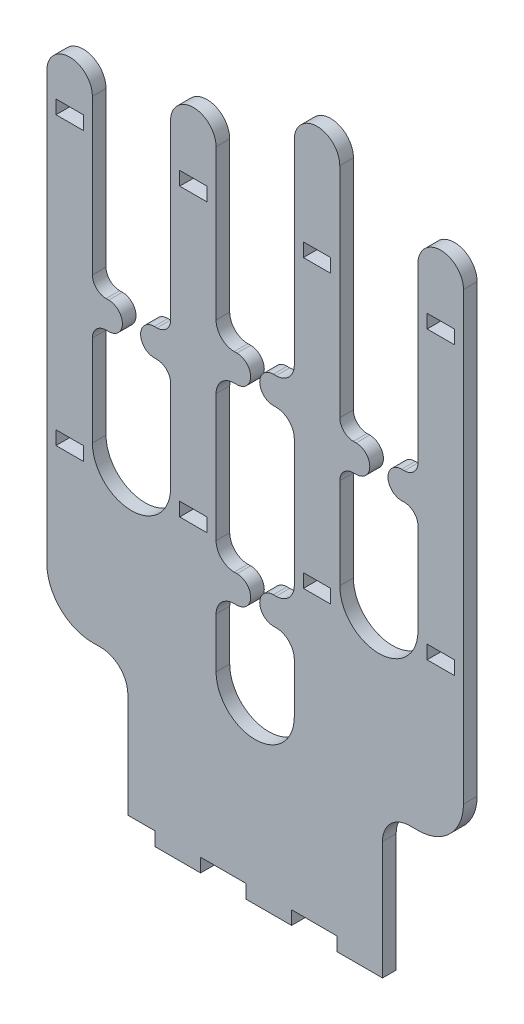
from build123d import *

# Parameters (mm, degrees)
SKETCH1_W           = 30
SKETCH1_H           = 15
BOSS_EXTRUDE1_DEPTH = 15
SKETCH2_W           = 30
SKETCH2_H           = 15
SKETCH2_W_2         = 50
CUT_EXTRUDE1_DEPTH  = 15


with BuildPart() as part:
    # Sketch1 → Boss-Extrude1 (new body)
    with BuildSketch(Plane.XY):
        with BuildLine():
            Line((0, 0), (-140, 0))
            Line((-140, 0), (-140, 130))
            ThreePointArc((-140, 130), (-148.786796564, 151.213203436), (-170, 160))
            Line((-170, 160), (-179, 160))
            ThreePointArc((-179, 160), (-214.355339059, 174.644660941), (-229, 210))
            Line((-229, 210), (-229, 680))
            ThreePointArc((-229, 680), (-204, 705), (-179, 680))
            Line((-179, 680), (-179, 510))
            ThreePointArc((-179, 510), (-174.606601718, 499.393398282), (-164, 495))
            Line((-164, 495), (-161, 495))
            ThreePointArc((-161, 495), (-146, 480), (-161, 465))
            Line((-161, 465), (-164, 465))
            ThreePointArc((-164, 465), (-174.606601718, 460.606601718), (-179, 450))
            Line((-179, 450), (-179, 350))
            ThreePointArc((-179, 350), (-136, 307), (-93, 350))
            Line((-93, 350), (-93, 450))
            ThreePointArc((-93, 450), (-97.393398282, 460.606601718), (-108, 465))
            Line((-108, 465), (-111, 465))
            ThreePointArc((-111, 465), (-126, 480), (-111, 495))
            Line((-111, 495), (-108, 495))
            ThreePointArc((-108, 495), (-97.393398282, 499.393398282), (-93, 510))
            Line((-93, 510), (-93, 700))
            ThreePointArc((-93, 700), (-68, 725), (-43, 700))
            Line((-43, 700), (-43, 535))
            ThreePointArc((-43, 535), (-37.142135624, 520.857864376), (-23, 515))
            Line((-23, 515), (-20, 515))
            ThreePointArc((-20, 515), (-5, 500), (-20, 485))
            Line((-20, 485), (-23, 485))
            ThreePointArc((-23, 485), (-37.142135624, 479.142135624), (-43, 465))
            Line((-43, 465), (-43, 325))
            ThreePointArc((-43, 325), (-37.142135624, 310.857864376), (-23, 305))
            Line((-23, 305), (-20, 305))
            ThreePointArc((-20, 305), (-5, 290), (-20, 275))
            Line((-20, 275), (-23, 275))
            ThreePointArc((-23, 275), (-37.142135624, 269.142135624), (-43, 255))
            Line((-43, 255), (-43, 200))
            ThreePointArc((-43, 200), (0, 157), (43, 200))
            Line((43, 200), (43, 255))
            ThreePointArc((43, 255), (37.142135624, 269.142135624), (23, 275))
            Line((23, 275), (20, 275))
            ThreePointArc((20, 275), (5, 290), (20, 305))
            Line((20, 305), (23, 305))
            ThreePointArc((23, 305), (37.142135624, 310.857864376), (43, 325))
            Line((43, 325), (43, 465))
            ThreePointArc((43, 465), (37.142135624, 479.142135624), (23, 485))
            Line((23, 485), (20, 485))
            ThreePointArc((20, 485), (5, 500), (20, 515))
            Line((20, 515), (23, 515))
            ThreePointArc((23, 515), (37.142135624, 520.857864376), (43, 535))
            Line((43, 535), (43, 750))
            ThreePointArc((43, 750), (68, 775), (93, 750))
            Line((93, 750), (93, 510))
            ThreePointArc((93, 510), (97.393398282, 499.393398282), (108, 495))
            Line((108, 495), (111, 495))
            ThreePointArc((111, 495), (126, 480), (111, 465))
            Line((111, 465), (108, 465))
            ThreePointArc((108, 465), (97.393398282, 460.606601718), (93, 450))
            Line((93, 450), (93, 350))
            ThreePointArc((93, 350), (136, 307), (179, 350))
            Line((179, 350), (179, 450))
            ThreePointArc((179, 450), (174.606601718, 460.606601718), (164, 465))
            Line((164, 465), (161, 465))
            ThreePointArc((161, 465), (146, 480), (161, 495))
            Line((161, 495), (164, 495))
            ThreePointArc((164, 495), (174.606601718, 499.393398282), (179, 510))
            Line((179, 510), (179, 700))
            ThreePointArc((179, 700), (204, 725), (229, 700))
            Line((229, 700), (229, 210))
            ThreePointArc((229, 210), (214.355339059, 174.644660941), (179, 160))
            Line((179, 160), (170, 160))
            ThreePointArc((170, 160), (148.786796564, 151.213203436), (140, 130))
            Line((140, 130), (140, 0))
            Line((140, 0), (0, 0))
        make_face()
        with Locations((204, 335)):
            Rectangle(SKETCH1_W, SKETCH1_H, mode=Mode.SUBTRACT)
        with Locations((204, 650)):
            Rectangle(SKETCH1_W, SKETCH1_H, mode=Mode.SUBTRACT)
        with Locations((68, 650)):
            Rectangle(SKETCH1_W, SKETCH1_H, mode=Mode.SUBTRACT)
        with Locations((68, 335)):
            Rectangle(SKETCH1_W, SKETCH1_H, mode=Mode.SUBTRACT)
        with Locations((-68, 335)):
            Rectangle(SKETCH1_W, SKETCH1_H, mode=Mode.SUBTRACT)
        with Locations((-68, 650)):
            Rectangle(SKETCH1_W, SKETCH1_H, mode=Mode.SUBTRACT)
        with Locations((-204, 650)):
            Rectangle(SKETCH1_W, SKETCH1_H, mode=Mode.SUBTRACT)
        with Locations((-204, 335)):
            Rectangle(SKETCH1_W, SKETCH1_H, mode=Mode.SUBTRACT)
    extrude(amount=BOSS_EXTRUDE1_DEPTH)

    # Sketch2 → Cut-Extrude1 (cut)
    with BuildSketch(Plane.XY.offset(15)):
        with Locations((-125, 7.5)):
            Rectangle(SKETCH2_W, SKETCH2_H)
        with Locations((-35, 7.5)):
            Rectangle(SKETCH2_W_2, SKETCH2_H)
        with Locations((65, 7.5)):
            Rectangle(SKETCH2_W_2, SKETCH2_H)
    extrude(amount=-CUT_EXTRUDE1_DEPTH, mode=Mode.SUBTRACT)


solid = part.part
